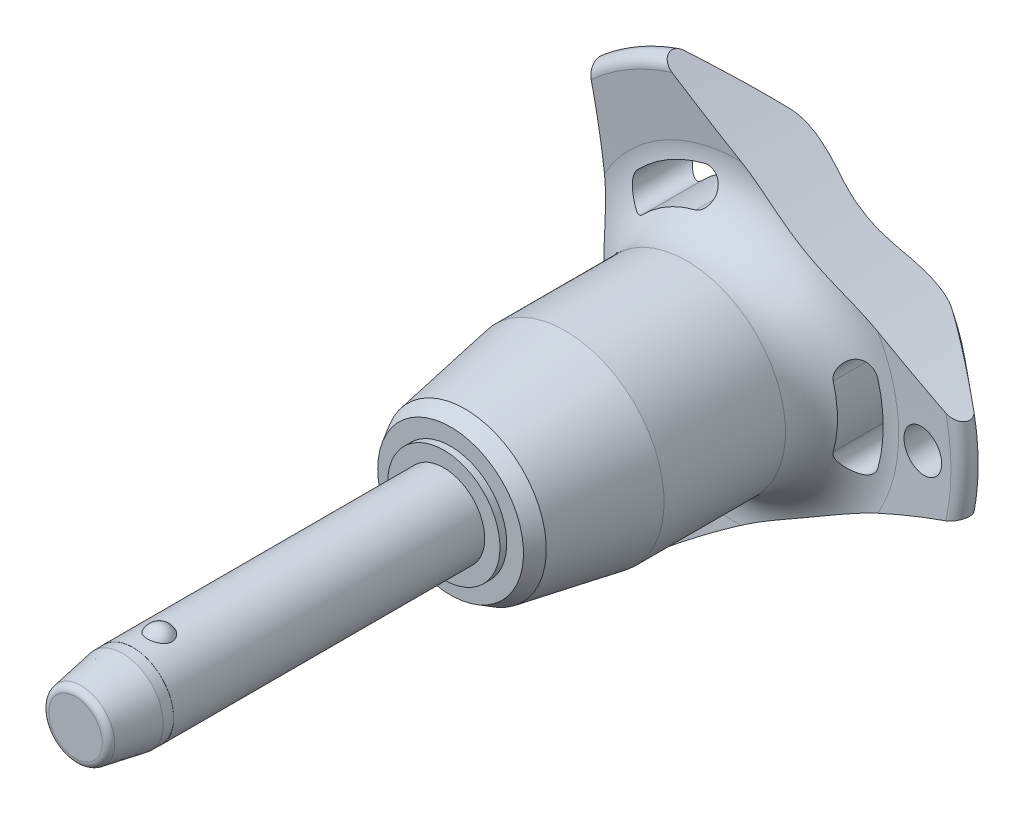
from build123d import *

# Parameters (mm, degrees)
SKETCH1_R           = 3
BOSS_EXTRUDE1_DEPTH = 20
SKETCH2_R           = 2.5
BOSS_EXTRUDE2_DEPTH = 26.7
BOSS_EXTRUDE3_START = 7
SKETCH1_2_R         = 3
BOSS_EXTRUDE3_DEPTH = 7
CHAMFER1_SIZE       = 3.5
CHAMFER1_SIZE2      = 0.617144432
FILLET1_R           = 0.5
SKETCH6_R           = 79.96
CUT_EXTRUDE1_DEPTH  = 53.269297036
CIRPATTERN1_COUNT   = 3
SKETCH7_R           = 1.5
CUT_EXTRUDE2_DEPTH  = 52.977278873
SKETCH8_R           = 3
SKETCH8_R_2         = 2.99
CUT_EXTRUDE3_DEPTH  = 4.2


with BuildPart() as part:
    # Sketch1 → Boss-Extrude1 (new body)
    with BuildSketch(Plane.XY):
        Circle(SKETCH1_R)
    extrude(amount=-BOSS_EXTRUDE1_DEPTH)

    # Sketch2 → Boss-Extrude2 (add)
    with BuildSketch(Plane(origin=(0, 0, -20), x_dir=(-1, 0, 0), z_dir=(0, 0, -1))):
        Circle(SKETCH2_R)
    extrude(amount=BOSS_EXTRUDE2_DEPTH)

    # Sketch3 → Revolve1 (revolve)
    with BuildSketch(Plane(origin=(0, 0, 0), x_dir=(0, 0, -1), z_dir=(1, 0, 0))):
        with BuildLine():
            Line((-0.866025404, 3.5), (-0.866025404, 1.5))
            ThreePointArc((-0.866025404, 1.5), (0.133974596, 2.5), (-0.866025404, 3.5))
        make_face()
        with BuildLine():
            Line((-0.866025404, -1.5), (-0.866025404, -3.5))
            ThreePointArc((-0.866025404, -3.5), (0.133974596, -2.5), (-0.866025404, -1.5))
        make_face()
    revolve(axis=Axis((0, -1.5, 0.866025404), (0, 1, 0)))

    # Sketch1_2 → Boss-Extrude3 (add)
    with BuildSketch(Plane.XY.offset(BOSS_EXTRUDE3_START)):
        Circle(SKETCH1_2_R)
    extrude(amount=-BOSS_EXTRUDE3_DEPTH)

    # Chamfer1
    chamfer1_edges = [part.edges().sort_by_distance(p)[0] for p in [
        (-3, 0, 7),
    ]]
    chamfer1_side = [part.faces().sort_by_distance(p)[0] for p in [
        (-3, 0, -6.5),
    ]]
    chamfer(chamfer1_edges, length=CHAMFER1_SIZE, length2=CHAMFER1_SIZE2, reference=chamfer1_side[0])

    # Fillet1
    fillet1_edges = [part.edges().sort_by_distance(p)[0] for p in [
        (-2.382855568, 0, 7),
        (2.5, 0, -46.7),
    ]]
    fillet(fillet1_edges, radius=FILLET1_R)

    # Sketch4 → Revolve2 (revolve)
    with BuildSketch(Plane(origin=(0, 0, 0), x_dir=(0, 0, -1), z_dir=(1, 0, 0)), mode=Mode.PRIVATE) as revolve2_sk:
        Polygon((20, 0), (20, 4.118359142), (20.5, 4.118359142), (20.5, 5.343400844), (21.560917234, 5.955921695), (28.9, 7.25), (37.8, 7.25), (37.8, 0), align=None)
    revolve(revolve2_sk.sketch.rotate(Axis((0, 0, -37.8), (0, 0, 1)), 90), axis=Axis((0, 0, -37.8), (0, 0, 1)))

    # Sketch5 → Revolve3 (revolve)
    with BuildSketch(Plane(origin=(0, 0, 0), x_dir=(0, 0, -1), z_dir=(1, 0, 0)), mode=Mode.PRIVATE) as revolve3_sk:
        with BuildLine():
            Line((41.78715932, 11.570250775), (41.452568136, 15.735949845))
            ThreePointArc((41.452568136, 15.735949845), (41.946485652, 16.540188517), (42.862835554, 16.314230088))
            Line((42.862835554, 16.314230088), (46.326414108, 12.186497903))
            ThreePointArc((46.326414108, 12.186497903), (46.7, 11.109282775), (46.261488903, 10.056825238))
            ThreePointArc((46.261488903, 10.056825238), (43.289873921, 5.413681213), (42.25, 0))
            Line((42.25, 0), (37.8, 0))
            Line((37.8, 0), (37.8, 7.25))
            ThreePointArc((37.8, 7.25), (40.739473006, 8.537160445), (41.78715932, 11.570250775))
        make_face()
    revolve(revolve3_sk.sketch.rotate(Axis((0, 0, -42.25), (0, 0, 1)), 90), axis=Axis((0, 0, -42.25), (0, 0, 1)))

    # Sketch6 → Cut-Extrude1 (cut, through all)
    with BuildSketch(Plane.XY):
        with Locations((-89.76, 0)):
            Circle(SKETCH6_R)
        with BuildLine():
            ThreePointArc((10.099921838, -2.834717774), (10.490188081, 0), (10.099921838, 2.834717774))
            ThreePointArc((10.099921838, 2.834717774), (8.768180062, 3.582738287), (8.020159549, 2.250996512))
            ThreePointArc((8.020159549, 2.250996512), (8.330062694, 0), (8.020159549, -2.250996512))
            ThreePointArc((8.020159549, -2.250996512), (8.768180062, -3.582738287), (10.099921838, -2.834717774))
        make_face()
    cut_extrude1 = extrude(amount=-CUT_EXTRUDE1_DEPTH, mode=Mode.SUBTRACT)

    # CirPattern1: Cut-Extrude1 ×3 about axis
    cirpattern1_axis = Axis((0, 0, 0), (0, 0, 1))
    for i in range(1, CIRPATTERN1_COUNT):
        add(cut_extrude1.rotate(cirpattern1_axis, i * 360 / CIRPATTERN1_COUNT), mode=Mode.SUBTRACT)

    # Sketch7 → Cut-Extrude2 (cut, through all)
    with BuildSketch(Plane.XY):
        with Locations(Location((13.490188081, 0, 0), (0, 0, 225.221865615))):
            Circle(SKETCH7_R)
    extrude(amount=-CUT_EXTRUDE2_DEPTH, mode=Mode.SUBTRACT)

    # Sketch8 → Cut-Extrude3 (cut)
    with BuildSketch(Plane.XY.offset(7)):
        Circle(SKETCH8_R)
        Circle(SKETCH8_R_2, mode=Mode.SUBTRACT)
    extrude(amount=-CUT_EXTRUDE3_DEPTH, mode=Mode.SUBTRACT)


solid = part.part
